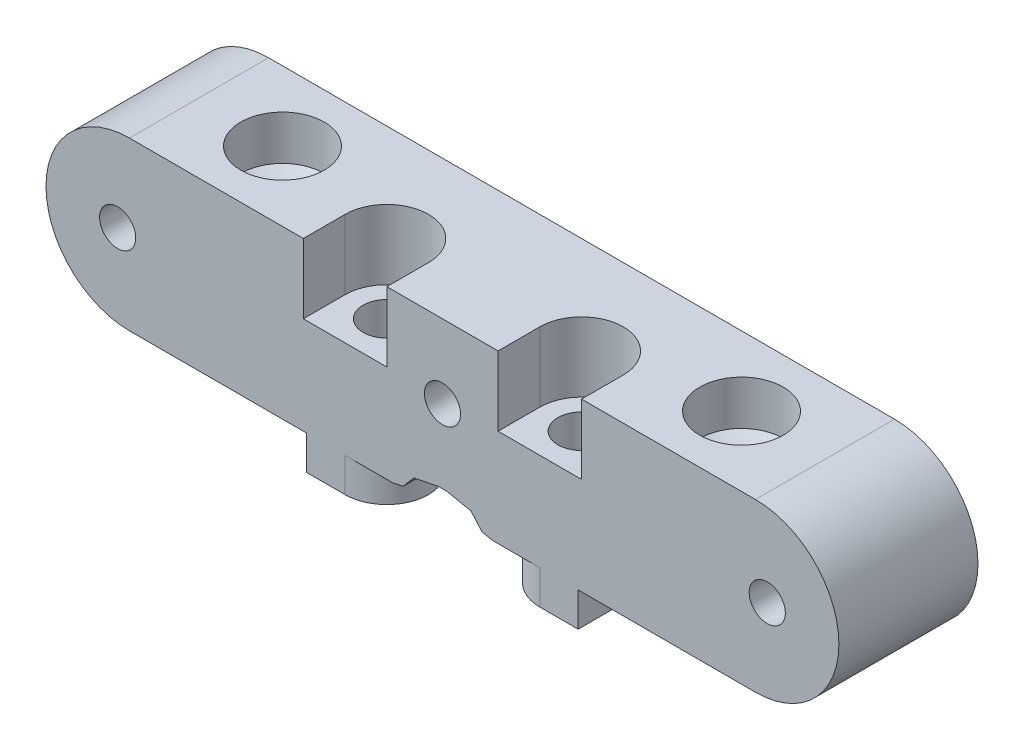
ISO-10303-21;
HEADER;
FILE_DESCRIPTION(('STEP AP214'),'2;1');
FILE_NAME('part.step','',(''),(''),'','','');
FILE_SCHEMA(('AUTOMOTIVE_DESIGN { 1 0 10303 214 1 1 1 1 }'));
ENDSEC;
DATA;
#1=APPLICATION_CONTEXT('core data for automotive mechanical design processes');
#2=APPLICATION_PROTOCOL_DEFINITION('international standard','automotive_design',2000,#1);
#3=PRODUCT_CONTEXT('',#1,'mechanical');
#4=PRODUCT('Part','Part','',(#3));
#5=PRODUCT_RELATED_PRODUCT_CATEGORY('part','',(#4));
#6=PRODUCT_DEFINITION_FORMATION('','',#4);
#7=PRODUCT_DEFINITION_CONTEXT('part definition',#1,'design');
#8=PRODUCT_DEFINITION('design','',#6,#7);
#9=PRODUCT_DEFINITION_SHAPE('','',#8);
#10=(LENGTH_UNIT() NAMED_UNIT(*) SI_UNIT(.MILLI.,.METRE.));
#11=(NAMED_UNIT(*) PLANE_ANGLE_UNIT() SI_UNIT($,.RADIAN.));
#12=(NAMED_UNIT(*) SI_UNIT($,.STERADIAN.) SOLID_ANGLE_UNIT());
#13=UNCERTAINTY_MEASURE_WITH_UNIT(LENGTH_MEASURE(1.E-05),#10,'distance_accuracy_value','');
#14=(GEOMETRIC_REPRESENTATION_CONTEXT(3) GLOBAL_UNCERTAINTY_ASSIGNED_CONTEXT((#13)) GLOBAL_UNIT_ASSIGNED_CONTEXT((#10,
#11,#12)) REPRESENTATION_CONTEXT('',''));
#15=CARTESIAN_POINT('',(0.,0.,0.));
#16=DIRECTION('',(0.,0.,1.));
#17=DIRECTION('',(1.,0.,0.));
#18=AXIS2_PLACEMENT_3D('',#15,#16,#17);
#19=CARTESIAN_POINT('',(12.0000309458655,67.1652977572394,-3.00000000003));
#20=DIRECTION('',(3.17245792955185E-12,-1.,0.));
#21=DIRECTION('',(1.,3.17245792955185E-12,0.));
#22=AXIS2_PLACEMENT_3D('',#19,#20,#21);
#23=CYLINDRICAL_SURFACE('',#22,1.6999999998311);
#24=CARTESIAN_POINT('',(12.0000309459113,52.7152977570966,-3.00000000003));
#25=DIRECTION('',(3.17245792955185E-12,-1.,0.));
#26=DIRECTION('',(1.,3.17245792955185E-12,0.));
#27=AXIS2_PLACEMENT_3D('',#24,#25,#26);
#28=CIRCLE('',#27,1.6999999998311);
#29=CARTESIAN_POINT('',(13.7000309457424,52.715297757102,-3.00000000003));
#30=VERTEX_POINT('',#29);
#31=EDGE_CURVE('E334',#30,#30,#28,.T.);
#32=ORIENTED_EDGE('',*,*,#31,.T.);
#33=EDGE_LOOP('',(#32));
#34=FACE_BOUND('',#33,.T.);
#35=CARTESIAN_POINT('',(12.0000309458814,62.1652977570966,-3.00000000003));
#36=DIRECTION('',(-3.17245792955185E-12,1.,0.));
#37=DIRECTION('',(-1.,-3.17245792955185E-12,0.));
#38=AXIS2_PLACEMENT_3D('',#35,#36,#37);
#39=CIRCLE('',#38,1.6999999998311);
#40=CARTESIAN_POINT('',(10.3000309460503,62.1652977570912,-3.00000000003));
#41=VERTEX_POINT('',#40);
#42=EDGE_CURVE('E317',#41,#41,#39,.F.);
#43=ORIENTED_EDGE('',*,*,#42,.F.);
#44=EDGE_LOOP('',(#43));
#45=FACE_BOUND('',#44,.T.);
#46=ADVANCED_FACE('F38',(#34,#45),#23,.F.);
#47=CARTESIAN_POINT('',(26.0000309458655,67.1652977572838,-3.00000000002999));
#48=DIRECTION('',(3.17245792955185E-12,-1.,0.));
#49=DIRECTION('',(1.,3.17245792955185E-12,0.));
#50=AXIS2_PLACEMENT_3D('',#47,#48,#49);
#51=CYLINDRICAL_SURFACE('',#50,1.69999999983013);
#52=CARTESIAN_POINT('',(26.0000309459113,52.715297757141,-3.00000000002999));
#53=DIRECTION('',(3.17245792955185E-12,-1.,0.));
#54=DIRECTION('',(1.,3.17245792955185E-12,0.));
#55=AXIS2_PLACEMENT_3D('',#52,#53,#54);
#56=CIRCLE('',#55,1.69999999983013);
#57=CARTESIAN_POINT('',(27.7000309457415,52.7152977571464,-3.00000000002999));
#58=VERTEX_POINT('',#57);
#59=EDGE_CURVE('E338',#58,#58,#56,.T.);
#60=ORIENTED_EDGE('',*,*,#59,.T.);
#61=EDGE_LOOP('',(#60));
#62=FACE_BOUND('',#61,.T.);
#63=CARTESIAN_POINT('',(26.0000309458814,62.165297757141,-3.00000000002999));
#64=DIRECTION('',(-3.17245792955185E-12,1.,0.));
#65=DIRECTION('',(-1.,-3.17245792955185E-12,0.));
#66=AXIS2_PLACEMENT_3D('',#63,#64,#65);
#67=CIRCLE('',#66,1.69999999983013);
#68=CARTESIAN_POINT('',(24.3000309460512,62.1652977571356,-3.00000000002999));
#69=VERTEX_POINT('',#68);
#70=EDGE_CURVE('E287',#69,#69,#67,.F.);
#71=ORIENTED_EDGE('',*,*,#70,.F.);
#72=EDGE_LOOP('',(#71));
#73=FACE_BOUND('',#72,.T.);
#74=ADVANCED_FACE('F526',(#62,#73),#51,.F.);
#75=CARTESIAN_POINT('',(-1.75009586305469E-10,55.1652977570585,0.));
#76=DIRECTION('',(3.17245792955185E-12,-1.,0.));
#77=DIRECTION('',(1.,3.17245792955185E-12,0.));
#78=AXIS2_PLACEMENT_3D('',#75,#76,#77);
#79=PLANE('',#78);
#80=CARTESIAN_POINT('',(2.49999999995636,55.1652977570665,-5.));
#81=DIRECTION('',(-3.17245792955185E-12,1.,0.));
#82=DIRECTION('',(-1.,-3.17245792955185E-12,0.));
#83=AXIS2_PLACEMENT_3D('',#80,#81,#82);
#84=CIRCLE('',#83,1.7);
#85=CARTESIAN_POINT('',(0.799999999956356,55.1652977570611,-5.));
#86=VERTEX_POINT('',#85);
#87=EDGE_CURVE('E449',#86,#86,#84,.T.);
#88=ORIENTED_EDGE('',*,*,#87,.T.);
#89=EDGE_LOOP('',(#88));
#90=FACE_BOUND('',#89,.T.);
#91=DIRECTION('',(1.,3.17245792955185E-12,0.));
#92=VECTOR('',#91,1.);
#93=CARTESIAN_POINT('',(-3.50000000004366,55.1652977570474,0.));
#94=LINE('',#93,#92);
#95=CARTESIAN_POINT('',(12.0000309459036,55.1652977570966,0.));
#96=VERTEX_POINT('',#95);
#97=CARTESIAN_POINT('',(15.4049397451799,55.1652977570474,0.));
#98=VERTEX_POINT('',#97);
#99=EDGE_CURVE('E461',#96,#98,#94,.T.);
#100=ORIENTED_EDGE('',*,*,#99,.F.);
#101=CARTESIAN_POINT('',(12.0000309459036,55.1652977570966,-3.00000000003));
#102=DIRECTION('',(3.17245792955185E-12,-1.,0.));
#103=DIRECTION('',(1.,3.17245792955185E-12,0.));
#104=AXIS2_PLACEMENT_3D('',#101,#102,#103);
#105=CIRCLE('',#104,3.00000000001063);
#106=CARTESIAN_POINT('',(12.0000309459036,55.1652977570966,-6.00000000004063));
#107=VERTEX_POINT('',#106);
#108=EDGE_CURVE('E344',#107,#96,#105,.T.);
#109=ORIENTED_EDGE('',*,*,#108,.F.);
#110=DIRECTION('',(1.,3.17251022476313E-12,-1.47436747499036E-11));
#111=VECTOR('',#110,1.);
#112=CARTESIAN_POINT('',(12.0000309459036,55.1652977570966,-6.00000000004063));
#113=LINE('',#112,#111);
#114=CARTESIAN_POINT('',(9.24416707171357,55.1652977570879,-6.));
#115=VERTEX_POINT('',#114);
#116=EDGE_CURVE('E350',#115,#107,#113,.T.);
#117=ORIENTED_EDGE('',*,*,#116,.F.);
#118=DIRECTION('',(-7.49978782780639E-12,0.,-1.));
#119=VECTOR('',#118,1.);
#120=CARTESIAN_POINT('',(9.24416707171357,55.1652977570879,-6.));
#121=LINE('',#120,#119);
#122=CARTESIAN_POINT('',(9.24416707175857,55.1652977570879,0.));
#123=VERTEX_POINT('',#122);
#124=EDGE_CURVE('E357',#123,#115,#121,.T.);
#125=ORIENTED_EDGE('',*,*,#124,.F.);
#126=CARTESIAN_POINT('',(-3.50000000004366,55.1652977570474,0.));
#127=VERTEX_POINT('',#126);
#128=EDGE_CURVE('E235',#127,#123,#94,.T.);
#129=ORIENTED_EDGE('',*,*,#128,.F.);
#130=DIRECTION('',(0.,0.,1.));
#131=VECTOR('',#130,1.);
#132=CARTESIAN_POINT('',(-3.50000000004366,55.1652977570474,0.));
#133=LINE('',#132,#131);
#134=CARTESIAN_POINT('',(-3.50000000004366,55.1652977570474,-9.99999999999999));
#135=VERTEX_POINT('',#134);
#136=EDGE_CURVE('E227',#135,#127,#133,.T.);
#137=ORIENTED_EDGE('',*,*,#136,.F.);
#138=DIRECTION('',(-1.,-3.17245792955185E-12,0.));
#139=VECTOR('',#138,1.);
#140=CARTESIAN_POINT('',(-3.50000000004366,55.1652977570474,-9.99999999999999));
#141=LINE('',#140,#139);
#142=CARTESIAN_POINT('',(15.4049397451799,55.1652977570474,-9.99999999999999));
#143=VERTEX_POINT('',#142);
#144=EDGE_CURVE('E232',#143,#135,#141,.T.);
#145=ORIENTED_EDGE('',*,*,#144,.F.);
#146=DIRECTION('',(0.,0.,-1.));
#147=VECTOR('',#146,1.);
#148=CARTESIAN_POINT('',(15.4049397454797,55.1652977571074,0.));
#149=LINE('',#148,#147);
#150=EDGE_CURVE('E447',#98,#143,#149,.T.);
#151=ORIENTED_EDGE('',*,*,#150,.F.);
#152=EDGE_LOOP('',(#100,#109,#117,#125,#129,#137,#145,#151));
#153=FACE_BOUND('',#152,.T.);
#154=ADVANCED_FACE('F230',(#90,#153),#79,.T.);
#155=CARTESIAN_POINT('',(35.500059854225,55.1652977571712,-5.));
#156=DIRECTION('',(-3.17245792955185E-12,1.,0.));
#157=DIRECTION('',(-1.,-3.17245792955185E-12,0.));
#158=AXIS2_PLACEMENT_3D('',#155,#156,#157);
#159=CIRCLE('',#158,1.7);
#160=CARTESIAN_POINT('',(33.800059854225,55.1652977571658,-5.));
#161=VERTEX_POINT('',#160);
#162=EDGE_CURVE('E241',#161,#161,#159,.T.);
#163=ORIENTED_EDGE('',*,*,#162,.T.);
#164=EDGE_LOOP('',(#163));
#165=FACE_BOUND('',#164,.T.);
#166=DIRECTION('',(1.,3.17251022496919E-12,1.43609592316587E-11));
#167=VECTOR('',#166,1.);
#168=CARTESIAN_POINT('',(28.7558948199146,55.1652977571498,-6.));
#169=LINE('',#168,#167);
#170=CARTESIAN_POINT('',(26.0000309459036,55.165297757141,-6.00000000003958));
#171=VERTEX_POINT('',#170);
#172=CARTESIAN_POINT('',(28.7558948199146,55.1652977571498,-6.));
#173=VERTEX_POINT('',#172);
#174=EDGE_CURVE('E381',#171,#173,#169,.T.);
#175=ORIENTED_EDGE('',*,*,#174,.F.);
#176=CARTESIAN_POINT('',(26.0000309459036,55.165297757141,-3.00000000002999));
#177=DIRECTION('',(3.17245792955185E-12,-1.,0.));
#178=DIRECTION('',(1.,3.17245792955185E-12,0.));
#179=AXIS2_PLACEMENT_3D('',#176,#177,#178);
#180=CIRCLE('',#179,3.00000000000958);
#181=CARTESIAN_POINT('',(26.0000380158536,55.165297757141,-2.87426332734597E-11));
#182=VERTEX_POINT('',#181);
#183=EDGE_CURVE('E379',#182,#171,#180,.T.);
#184=ORIENTED_EDGE('',*,*,#183,.F.);
#185=CARTESIAN_POINT('',(22.5951221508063,55.1652977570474,0.));
#186=VERTEX_POINT('',#185);
#187=EDGE_CURVE('E462',#186,#182,#94,.T.);
#188=ORIENTED_EDGE('',*,*,#187,.F.);
#189=DIRECTION('',(0.,0.,1.));
#190=VECTOR('',#189,1.);
#191=CARTESIAN_POINT('',(22.5951221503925,55.1652977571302,0.));
#192=LINE('',#191,#190);
#193=CARTESIAN_POINT('',(22.5951221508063,55.1652977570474,-9.99999999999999));
#194=VERTEX_POINT('',#193);
#195=EDGE_CURVE('E434',#194,#186,#192,.T.);
#196=ORIENTED_EDGE('',*,*,#195,.F.);
#197=CARTESIAN_POINT('',(41.5000618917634,55.1652977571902,-9.99999999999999));
#198=VERTEX_POINT('',#197);
#199=EDGE_CURVE('E249',#198,#194,#141,.T.);
#200=ORIENTED_EDGE('',*,*,#199,.F.);
#201=DIRECTION('',(0.,0.,-1.));
#202=VECTOR('',#201,1.);
#203=CARTESIAN_POINT('',(41.5000618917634,55.1652977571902,0.));
#204=LINE('',#203,#202);
#205=CARTESIAN_POINT('',(41.5000618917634,55.1652977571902,0.));
#206=VERTEX_POINT('',#205);
#207=EDGE_CURVE('E250',#206,#198,#204,.T.);
#208=ORIENTED_EDGE('',*,*,#207,.F.);
#209=CARTESIAN_POINT('',(28.7558948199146,55.1652977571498,0.));
#210=VERTEX_POINT('',#209);
#211=EDGE_CURVE('E240',#210,#206,#94,.T.);
#212=ORIENTED_EDGE('',*,*,#211,.F.);
#213=DIRECTION('',(-1.71107341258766E-11,0.,1.));
#214=VECTOR('',#213,1.);
#215=CARTESIAN_POINT('',(28.7558948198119,55.1652977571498,0.));
#216=LINE('',#215,#214);
#217=EDGE_CURVE('E372',#173,#210,#216,.T.);
#218=ORIENTED_EDGE('',*,*,#217,.F.);
#219=EDGE_LOOP('',(#175,#184,#188,#196,#200,#208,#212,#218));
#220=FACE_BOUND('',#219,.T.);
#221=ADVANCED_FACE('F610',(#165,#220),#79,.T.);
#222=CARTESIAN_POINT('',(-2.13079081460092E-10,67.1652977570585,0.));
#223=DIRECTION('',(3.17245792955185E-12,-1.,0.));
#224=DIRECTION('',(1.,3.17245792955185E-12,0.));
#225=AXIS2_PLACEMENT_3D('',#222,#223,#224);
#226=PLANE('',#225);
#227=CARTESIAN_POINT('',(35.5000598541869,67.1652977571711,-5.));
#228=DIRECTION('',(0.,1.,0.));
#229=DIRECTION('',(0.,0.,1.));
#230=AXIS2_PLACEMENT_3D('',#227,#228,#229);
#231=CIRCLE('',#230,2.99999999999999);
#232=CARTESIAN_POINT('',(35.5000598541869,67.1652977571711,-2.00000000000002));
#233=VERTEX_POINT('',#232);
#234=EDGE_CURVE('E320',#233,#233,#231,.T.);
#235=ORIENTED_EDGE('',*,*,#234,.F.);
#236=EDGE_LOOP('',(#235));
#237=FACE_BOUND('',#236,.T.);
#238=CARTESIAN_POINT('',(2.49999999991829,67.1652977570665,-5.));
#239=DIRECTION('',(0.,1.,0.));
#240=DIRECTION('',(0.,0.,1.));
#241=AXIS2_PLACEMENT_3D('',#238,#239,#240);
#242=CIRCLE('',#241,2.99999999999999);
#243=CARTESIAN_POINT('',(2.49999999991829,67.1652977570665,-2.00000000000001));
#244=VERTEX_POINT('',#243);
#245=EDGE_CURVE('E327',#244,#244,#242,.T.);
#246=ORIENTED_EDGE('',*,*,#245,.F.);
#247=EDGE_LOOP('',(#246));
#248=FACE_BOUND('',#247,.T.);
#249=CARTESIAN_POINT('',(12.0000309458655,67.1652977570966,-3.00000000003));
#250=DIRECTION('',(-3.17245792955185E-12,1.,0.));
#251=DIRECTION('',(-1.,-3.17245792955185E-12,0.));
#252=AXIS2_PLACEMENT_3D('',#249,#250,#251);
#253=CIRCLE('',#252,3.);
#254=CARTESIAN_POINT('',(15.0000309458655,67.1652977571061,-3.00000000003));
#255=VERTEX_POINT('',#254);
#256=CARTESIAN_POINT('',(9.0000309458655,67.1652977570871,-3.00000000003));
#257=VERTEX_POINT('',#256);
#258=EDGE_CURVE('E277',#255,#257,#253,.T.);
#259=ORIENTED_EDGE('',*,*,#258,.F.);
#260=DIRECTION('',(0.,0.,-1.));
#261=VECTOR('',#260,1.);
#262=CARTESIAN_POINT('',(15.0000309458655,67.1652977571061,-3.00000000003));
#263=LINE('',#262,#261);
#264=CARTESIAN_POINT('',(15.0000309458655,67.1652977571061,0.));
#265=VERTEX_POINT('',#264);
#266=EDGE_CURVE('E271',#265,#255,#263,.T.);
#267=ORIENTED_EDGE('',*,*,#266,.F.);
#268=DIRECTION('',(-1.,-1.50274040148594E-11,0.));
#269=VECTOR('',#268,1.);
#270=CARTESIAN_POINT('',(-3.50000000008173,67.1652977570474,0.));
#271=LINE('',#270,#269);
#272=CARTESIAN_POINT('',(23.0000309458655,67.1652977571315,0.));
#273=VERTEX_POINT('',#272);
#274=EDGE_CURVE('E345',#273,#265,#271,.T.);
#275=ORIENTED_EDGE('',*,*,#274,.F.);
#276=DIRECTION('',(0.,0.,1.));
#277=VECTOR('',#276,1.);
#278=CARTESIAN_POINT('',(23.0000309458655,67.1652977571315,-3.00000000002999));
#279=LINE('',#278,#277);
#280=CARTESIAN_POINT('',(23.0000309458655,67.1652977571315,-3.00000000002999));
#281=VERTEX_POINT('',#280);
#282=EDGE_CURVE('E304',#281,#273,#279,.T.);
#283=ORIENTED_EDGE('',*,*,#282,.F.);
#284=CARTESIAN_POINT('',(26.0000309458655,67.165297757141,-3.00000000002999));
#285=DIRECTION('',(-3.17245792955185E-12,1.,0.));
#286=DIRECTION('',(-1.,-3.17245792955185E-12,0.));
#287=AXIS2_PLACEMENT_3D('',#284,#285,#286);
#288=CIRCLE('',#287,3.);
#289=CARTESIAN_POINT('',(29.0000309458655,67.1652977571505,-3.00000000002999));
#290=VERTEX_POINT('',#289);
#291=EDGE_CURVE('E267',#290,#281,#288,.T.);
#292=ORIENTED_EDGE('',*,*,#291,.F.);
#293=DIRECTION('',(0.,0.,-1.));
#294=VECTOR('',#293,1.);
#295=CARTESIAN_POINT('',(29.0000309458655,67.1652977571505,-3.00000000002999));
#296=LINE('',#295,#294);
#297=CARTESIAN_POINT('',(29.0000309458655,67.1652977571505,0.));
#298=VERTEX_POINT('',#297);
#299=EDGE_CURVE('E296',#298,#290,#296,.T.);
#300=ORIENTED_EDGE('',*,*,#299,.F.);
#301=CARTESIAN_POINT('',(41.5000618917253,67.1652977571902,0.));
#302=VERTEX_POINT('',#301);
#303=EDGE_CURVE('E341',#302,#298,#271,.T.);
#304=ORIENTED_EDGE('',*,*,#303,.F.);
#305=DIRECTION('',(0.,0.,-1.));
#306=VECTOR('',#305,1.);
#307=CARTESIAN_POINT('',(41.5000618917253,67.1652977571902,0.));
#308=LINE('',#307,#306);
#309=CARTESIAN_POINT('',(41.5000618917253,67.1652977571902,-9.99999999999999));
#310=VERTEX_POINT('',#309);
#311=EDGE_CURVE('E455',#302,#310,#308,.T.);
#312=ORIENTED_EDGE('',*,*,#311,.T.);
#313=DIRECTION('',(-1.,-3.17245792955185E-12,0.));
#314=VECTOR('',#313,1.);
#315=CARTESIAN_POINT('',(-3.50000000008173,67.1652977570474,-9.99999999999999));
#316=LINE('',#315,#314);
#317=CARTESIAN_POINT('',(-3.50000000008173,67.1652977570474,-9.99999999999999));
#318=VERTEX_POINT('',#317);
#319=EDGE_CURVE('E47',#310,#318,#316,.T.);
#320=ORIENTED_EDGE('',*,*,#319,.T.);
#321=DIRECTION('',(0.,0.,1.));
#322=VECTOR('',#321,1.);
#323=CARTESIAN_POINT('',(-3.50000000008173,67.1652977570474,0.));
#324=LINE('',#323,#322);
#325=CARTESIAN_POINT('',(-3.50000000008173,67.1652977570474,0.));
#326=VERTEX_POINT('',#325);
#327=EDGE_CURVE('E255',#318,#326,#324,.T.);
#328=ORIENTED_EDGE('',*,*,#327,.T.);
#329=CARTESIAN_POINT('',(9.0000309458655,67.1652977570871,0.));
#330=VERTEX_POINT('',#329);
#331=EDGE_CURVE('E337',#330,#326,#271,.T.);
#332=ORIENTED_EDGE('',*,*,#331,.F.);
#333=DIRECTION('',(0.,0.,1.));
#334=VECTOR('',#333,1.);
#335=CARTESIAN_POINT('',(9.0000309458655,67.1652977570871,-3.00000000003));
#336=LINE('',#335,#334);
#337=EDGE_CURVE('E280',#257,#330,#336,.T.);
#338=ORIENTED_EDGE('',*,*,#337,.F.);
#339=EDGE_LOOP('',(#259,#267,#275,#283,#292,#300,#304,#312,#320,#328,#332,#338));
#340=FACE_BOUND('',#339,.T.);
#341=ADVANCED_FACE('F607',(#237,#248,#340),#226,.F.);
#342=CARTESIAN_POINT('',(-3.50000000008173,67.1652977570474,0.));
#343=DIRECTION('',(0.,0.,-1.));
#344=DIRECTION('',(-1.,0.,0.));
#345=AXIS2_PLACEMENT_3D('',#342,#343,#344);
#346=PLANE('',#345);
#347=CARTESIAN_POINT('',(-4.35000000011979,61.1652977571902,0.));
#348=DIRECTION('',(0.,0.,-1.));
#349=DIRECTION('',(-1.,0.,0.));
#350=AXIS2_PLACEMENT_3D('',#347,#348,#349);
#351=CIRCLE('',#350,1.3);
#352=CARTESIAN_POINT('',(-5.65000000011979,61.1652977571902,0.));
#353=VERTEX_POINT('',#352);
#354=EDGE_CURVE('E257',#353,#353,#351,.T.);
#355=ORIENTED_EDGE('',*,*,#354,.T.);
#356=EDGE_LOOP('',(#355));
#357=FACE_BOUND('',#356,.T.);
#358=CARTESIAN_POINT('',(42.3500618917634,61.1652977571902,0.));
#359=DIRECTION('',(0.,0.,-1.));
#360=DIRECTION('',(-1.,0.,0.));
#361=AXIS2_PLACEMENT_3D('',#358,#359,#360);
#362=CIRCLE('',#361,1.3);
#363=CARTESIAN_POINT('',(41.0500618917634,61.1652977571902,0.));
#364=VERTEX_POINT('',#363);
#365=EDGE_CURVE('E262',#364,#364,#362,.T.);
#366=ORIENTED_EDGE('',*,*,#365,.T.);
#367=EDGE_LOOP('',(#366));
#368=FACE_BOUND('',#367,.T.);
#369=CARTESIAN_POINT('',(19.0000309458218,61.8726338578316,0.));
#370=DIRECTION('',(0.,0.,-1.));
#371=DIRECTION('',(-1.,0.,0.));
#372=AXIS2_PLACEMENT_3D('',#369,#370,#371);
#373=CIRCLE('',#372,1.3);
#374=CARTESIAN_POINT('',(17.7000309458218,61.8726338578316,0.));
#375=VERTEX_POINT('',#374);
#376=EDGE_CURVE('E482',#375,#375,#373,.T.);
#377=ORIENTED_EDGE('',*,*,#376,.T.);
#378=EDGE_LOOP('',(#377));
#379=FACE_BOUND('',#378,.T.);
#380=ORIENTED_EDGE('',*,*,#274,.T.);
#381=DIRECTION('',(-3.17245792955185E-12,1.,0.));
#382=VECTOR('',#381,1.);
#383=CARTESIAN_POINT('',(15.0000309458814,62.1652977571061,0.));
#384=LINE('',#383,#382);
#385=CARTESIAN_POINT('',(15.0000309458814,62.1652977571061,0.));
#386=VERTEX_POINT('',#385);
#387=EDGE_CURVE('E288',#386,#265,#384,.T.);
#388=ORIENTED_EDGE('',*,*,#387,.F.);
#389=DIRECTION('',(1.,3.17245792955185E-12,0.));
#390=VECTOR('',#389,1.);
#391=CARTESIAN_POINT('',(-3.50000000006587,62.1652977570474,0.));
#392=LINE('',#391,#390);
#393=CARTESIAN_POINT('',(9.00003094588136,62.1652977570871,0.));
#394=VERTEX_POINT('',#393);
#395=EDGE_CURVE('E318',#394,#386,#392,.T.);
#396=ORIENTED_EDGE('',*,*,#395,.F.);
#397=DIRECTION('',(-3.17245792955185E-12,1.,0.));
#398=VECTOR('',#397,1.);
#399=CARTESIAN_POINT('',(9.00003094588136,62.1652977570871,0.));
#400=LINE('',#399,#398);
#401=EDGE_CURVE('E290',#394,#330,#400,.T.);
#402=ORIENTED_EDGE('',*,*,#401,.T.);
#403=ORIENTED_EDGE('',*,*,#331,.T.);
#404=CARTESIAN_POINT('',(-3.50000000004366,61.1652977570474,0.));
#405=DIRECTION('',(0.,0.,-1.));
#406=DIRECTION('',(-1.,0.,0.));
#407=AXIS2_PLACEMENT_3D('',#404,#405,#406);
#408=CIRCLE('',#407,6.);
#409=EDGE_CURVE('E256',#326,#127,#408,.F.);
#410=ORIENTED_EDGE('',*,*,#409,.T.);
#411=ORIENTED_EDGE('',*,*,#128,.T.);
#412=DIRECTION('',(-3.17245792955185E-12,1.,0.));
#413=VECTOR('',#412,1.);
#414=CARTESIAN_POINT('',(9.24416707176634,52.7152977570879,0.));
#415=LINE('',#414,#413);
#416=CARTESIAN_POINT('',(9.24416707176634,52.7152977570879,0.));
#417=VERTEX_POINT('',#416);
#418=EDGE_CURVE('E365',#417,#123,#415,.T.);
#419=ORIENTED_EDGE('',*,*,#418,.F.);
#420=DIRECTION('',(-1.,-3.1725212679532E-12,1.25928321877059E-11));
#421=VECTOR('',#420,1.);
#422=CARTESIAN_POINT('',(9.24416707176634,52.7152977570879,0.));
#423=LINE('',#422,#421);
#424=CARTESIAN_POINT('',(12.0000213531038,52.7152977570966,-3.47009668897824E-11));
#425=VERTEX_POINT('',#424);
#426=EDGE_CURVE('E349',#425,#417,#423,.T.);
#427=ORIENTED_EDGE('',*,*,#426,.F.);
#428=DIRECTION('',(-3.17245792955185E-12,1.,0.));
#429=VECTOR('',#428,1.);
#430=CARTESIAN_POINT('',(12.0000213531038,52.7152977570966,-3.47009668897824E-11));
#431=LINE('',#430,#429);
#432=EDGE_CURVE('E367',#425,#96,#431,.T.);
#433=ORIENTED_EDGE('',*,*,#432,.T.);
#434=ORIENTED_EDGE('',*,*,#99,.T.);
#435=DIRECTION('',(0.980562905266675,0.19620496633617,0.));
#436=VECTOR('',#435,1.);
#437=CARTESIAN_POINT('',(9.61383210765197,54.0065306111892,0.));
#438=LINE('',#437,#436);
#439=CARTESIAN_POINT('',(16.1573875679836,55.3158582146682,0.));
#440=VERTEX_POINT('',#439);
#441=EDGE_CURVE('E411',#98,#440,#438,.T.);
#442=ORIENTED_EDGE('',*,*,#441,.T.);
#443=DIRECTION('',(0.655175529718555,0.755476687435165,0.));
#444=VECTOR('',#443,1.);
#445=CARTESIAN_POINT('',(16.1573875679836,55.3158582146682,0.));
#446=LINE('',#445,#444);
#447=CARTESIAN_POINT('',(16.9502580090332,56.2301095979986,0.));
#448=VERTEX_POINT('',#447);
#449=EDGE_CURVE('E414',#440,#448,#446,.T.);
#450=ORIENTED_EDGE('',*,*,#449,.T.);
#451=DIRECTION('',(0.980600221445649,0.196018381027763,0.));
#452=VECTOR('',#451,1.);
#453=CARTESIAN_POINT('',(16.9502580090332,56.2301095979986,0.));
#454=LINE('',#453,#452);
#455=CARTESIAN_POINT('',(18.7004670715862,56.5799699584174,0.));
#456=VERTEX_POINT('',#455);
#457=EDGE_CURVE('E395',#448,#456,#454,.T.);
#458=ORIENTED_EDGE('',*,*,#457,.T.);
#459=DIRECTION('',(1.,9.27575153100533E-11,0.));
#460=VECTOR('',#459,1.);
#461=CARTESIAN_POINT('',(18.7004670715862,56.5799699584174,0.));
#462=LINE('',#461,#460);
#463=CARTESIAN_POINT('',(19.2995948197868,56.579969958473,0.));
#464=VERTEX_POINT('',#463);
#465=EDGE_CURVE('E398',#456,#464,#462,.T.);
#466=ORIENTED_EDGE('',*,*,#465,.T.);
#467=DIRECTION('',(0.980600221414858,-0.196018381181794,0.));
#468=VECTOR('',#467,1.);
#469=CARTESIAN_POINT('',(19.2995948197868,56.579969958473,0.));
#470=LINE('',#469,#468);
#471=CARTESIAN_POINT('',(21.0498040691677,56.2301095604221,0.));
#472=VERTEX_POINT('',#471);
#473=EDGE_CURVE('E402',#464,#472,#470,.T.);
#474=ORIENTED_EDGE('',*,*,#473,.T.);
#475=DIRECTION('',(0.655175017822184,-0.755477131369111,0.));
#476=VECTOR('',#475,1.);
#477=CARTESIAN_POINT('',(21.0498040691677,56.2301095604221,0.));
#478=LINE('',#477,#476);
#479=CARTESIAN_POINT('',(21.842673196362,55.3158584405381,0.));
#480=VERTEX_POINT('',#479);
#481=EDGE_CURVE('E405',#472,#480,#478,.T.);
#482=ORIENTED_EDGE('',*,*,#481,.T.);
#483=DIRECTION('',(0.980562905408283,-0.196204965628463,0.));
#484=VECTOR('',#483,1.);
#485=CARTESIAN_POINT('',(21.842673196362,55.3158584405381,0.));
#486=LINE('',#485,#484);
#487=EDGE_CURVE('E408',#480,#186,#486,.T.);
#488=ORIENTED_EDGE('',*,*,#487,.T.);
#489=ORIENTED_EDGE('',*,*,#187,.T.);
#490=DIRECTION('',(-3.17245792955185E-12,1.,0.));
#491=VECTOR('',#490,1.);
#492=CARTESIAN_POINT('',(26.0000380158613,52.715297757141,-2.87426332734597E-11));
#493=LINE('',#492,#491);
#494=CARTESIAN_POINT('',(26.0000380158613,52.715297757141,-2.87426332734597E-11));
#495=VERTEX_POINT('',#494);
#496=EDGE_CURVE('E392',#495,#182,#493,.T.);
#497=ORIENTED_EDGE('',*,*,#496,.F.);
#498=DIRECTION('',(-1.,-3.1725183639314E-12,-1.04313851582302E-11));
#499=VECTOR('',#498,1.);
#500=CARTESIAN_POINT('',(26.0000380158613,52.715297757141,-2.87426254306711E-11));
#501=LINE('',#500,#499);
#502=CARTESIAN_POINT('',(28.7558948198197,52.7152977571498,0.));
#503=VERTEX_POINT('',#502);
#504=EDGE_CURVE('E368',#503,#495,#501,.T.);
#505=ORIENTED_EDGE('',*,*,#504,.F.);
#506=DIRECTION('',(-3.17245792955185E-12,1.,0.));
#507=VECTOR('',#506,1.);
#508=CARTESIAN_POINT('',(28.7558948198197,52.7152977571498,0.));
#509=LINE('',#508,#507);
#510=EDGE_CURVE('E378',#503,#210,#509,.T.);
#511=ORIENTED_EDGE('',*,*,#510,.T.);
#512=ORIENTED_EDGE('',*,*,#211,.T.);
#513=CARTESIAN_POINT('',(41.5000618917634,61.1652977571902,0.));
#514=DIRECTION('',(0.,0.,-1.));
#515=DIRECTION('',(-1.,0.,0.));
#516=AXIS2_PLACEMENT_3D('',#513,#514,#515);
#517=CIRCLE('',#516,6.);
#518=EDGE_CURVE('E265',#206,#302,#517,.F.);
#519=ORIENTED_EDGE('',*,*,#518,.T.);
#520=ORIENTED_EDGE('',*,*,#303,.T.);
#521=DIRECTION('',(-3.17245792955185E-12,1.,0.));
#522=VECTOR('',#521,1.);
#523=CARTESIAN_POINT('',(29.0000309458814,62.1652977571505,0.));
#524=LINE('',#523,#522);
#525=CARTESIAN_POINT('',(29.0000309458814,62.1652977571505,0.));
#526=VERTEX_POINT('',#525);
#527=EDGE_CURVE('E309',#526,#298,#524,.T.);
#528=ORIENTED_EDGE('',*,*,#527,.F.);
#529=DIRECTION('',(1.,3.17245792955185E-12,0.));
#530=VECTOR('',#529,1.);
#531=CARTESIAN_POINT('',(-3.50000000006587,62.1652977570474,0.));
#532=LINE('',#531,#530);
#533=CARTESIAN_POINT('',(23.0000309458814,62.1652977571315,0.));
#534=VERTEX_POINT('',#533);
#535=EDGE_CURVE('E315',#534,#526,#532,.T.);
#536=ORIENTED_EDGE('',*,*,#535,.F.);
#537=DIRECTION('',(-3.17245792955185E-12,1.,0.));
#538=VECTOR('',#537,1.);
#539=CARTESIAN_POINT('',(23.0000309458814,62.1652977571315,0.));
#540=LINE('',#539,#538);
#541=EDGE_CURVE('E311',#534,#273,#540,.T.);
#542=ORIENTED_EDGE('',*,*,#541,.T.);
#543=EDGE_LOOP('',(#380,#388,#396,#402,#403,#410,#411,#419,#427,#433,#434,#442,#450,#458,#466,
#474,#482,#488,#489,#497,#505,#511,#512,#519,#520,#528,#536,#542));
#544=FACE_BOUND('',#543,.T.);
#545=ADVANCED_FACE('F40',(#357,#368,#379,#544),#346,.F.);
#546=CARTESIAN_POINT('',(-3.50000000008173,67.1652977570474,-9.99999999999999));
#547=DIRECTION('',(0.,0.,1.));
#548=DIRECTION('',(1.,0.,0.));
#549=AXIS2_PLACEMENT_3D('',#546,#547,#548);
#550=PLANE('',#549);
#551=CARTESIAN_POINT('',(19.0000309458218,61.8726338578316,-9.99999999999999));
#552=DIRECTION('',(0.,0.,-1.));
#553=DIRECTION('',(-1.,0.,0.));
#554=AXIS2_PLACEMENT_3D('',#551,#552,#553);
#555=CIRCLE('',#554,2.3);
#556=CARTESIAN_POINT('',(16.7000309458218,61.8726338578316,-9.99999999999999));
#557=VERTEX_POINT('',#556);
#558=EDGE_CURVE('E623',#557,#557,#555,.T.);
#559=ORIENTED_EDGE('',*,*,#558,.F.);
#560=EDGE_LOOP('',(#559));
#561=FACE_BOUND('',#560,.T.);
#562=CARTESIAN_POINT('',(42.3500618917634,61.1652977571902,-9.99999999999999));
#563=DIRECTION('',(0.,0.,-1.));
#564=DIRECTION('',(-1.,0.,0.));
#565=AXIS2_PLACEMENT_3D('',#562,#563,#564);
#566=CIRCLE('',#565,2.3);
#567=CARTESIAN_POINT('',(40.0500618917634,61.1652977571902,-9.99999999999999));
#568=VERTEX_POINT('',#567);
#569=EDGE_CURVE('E493',#568,#568,#566,.T.);
#570=ORIENTED_EDGE('',*,*,#569,.F.);
#571=EDGE_LOOP('',(#570));
#572=FACE_BOUND('',#571,.T.);
#573=CARTESIAN_POINT('',(-4.35000000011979,61.1652977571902,-9.99999999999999));
#574=DIRECTION('',(0.,0.,-1.));
#575=DIRECTION('',(-1.,0.,0.));
#576=AXIS2_PLACEMENT_3D('',#573,#574,#575);
#577=CIRCLE('',#576,2.3);
#578=CARTESIAN_POINT('',(-6.65000000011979,61.1652977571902,-9.99999999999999));
#579=VERTEX_POINT('',#578);
#580=EDGE_CURVE('E486',#579,#579,#577,.T.);
#581=ORIENTED_EDGE('',*,*,#580,.F.);
#582=EDGE_LOOP('',(#581));
#583=FACE_BOUND('',#582,.T.);
#584=DIRECTION('',(0.655175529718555,0.755476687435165,0.));
#585=VECTOR('',#584,1.);
#586=CARTESIAN_POINT('',(16.1573875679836,55.3158582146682,-9.99999999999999));
#587=LINE('',#586,#585);
#588=CARTESIAN_POINT('',(16.1573875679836,55.3158582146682,-9.99999999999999));
#589=VERTEX_POINT('',#588);
#590=CARTESIAN_POINT('',(16.9502580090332,56.2301095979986,-9.99999999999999));
#591=VERTEX_POINT('',#590);
#592=EDGE_CURVE('E399',#589,#591,#587,.T.);
#593=ORIENTED_EDGE('',*,*,#592,.F.);
#594=DIRECTION('',(-0.980562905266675,-0.19620496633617,0.));
#595=VECTOR('',#594,1.);
#596=CARTESIAN_POINT('',(-0.463532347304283,51.9901082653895,-9.99999999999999));
#597=LINE('',#596,#595);
#598=EDGE_CURVE('E11',#589,#143,#597,.T.);
#599=ORIENTED_EDGE('',*,*,#598,.T.);
#600=ORIENTED_EDGE('',*,*,#144,.T.);
#601=CARTESIAN_POINT('',(-3.50000000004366,61.1652977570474,-9.99999999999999));
#602=DIRECTION('',(0.,0.,-1.));
#603=DIRECTION('',(1.,0.,0.));
#604=AXIS2_PLACEMENT_3D('',#601,#602,#603);
#605=CIRCLE('',#604,6.);
#606=EDGE_CURVE('E248',#135,#318,#605,.T.);
#607=ORIENTED_EDGE('',*,*,#606,.T.);
#608=ORIENTED_EDGE('',*,*,#319,.F.);
#609=CARTESIAN_POINT('',(41.5000618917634,61.1652977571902,-9.99999999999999));
#610=DIRECTION('',(0.,0.,-1.));
#611=DIRECTION('',(-1.,0.,0.));
#612=AXIS2_PLACEMENT_3D('',#609,#610,#611);
#613=CIRCLE('',#612,6.);
#614=EDGE_CURVE('E259',#310,#198,#613,.T.);
#615=ORIENTED_EDGE('',*,*,#614,.T.);
#616=ORIENTED_EDGE('',*,*,#199,.T.);
#617=DIRECTION('',(0.980562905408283,-0.196204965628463,0.));
#618=VECTOR('',#617,1.);
#619=CARTESIAN_POINT('',(21.842673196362,55.3158584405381,-9.99999999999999));
#620=LINE('',#619,#618);
#621=CARTESIAN_POINT('',(21.842673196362,55.3158584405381,-9.99999999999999));
#622=VERTEX_POINT('',#621);
#623=EDGE_CURVE('E428',#622,#194,#620,.T.);
#624=ORIENTED_EDGE('',*,*,#623,.F.);
#625=DIRECTION('',(0.655175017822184,-0.755477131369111,0.));
#626=VECTOR('',#625,1.);
#627=CARTESIAN_POINT('',(21.0498040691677,56.2301095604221,-9.99999999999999));
#628=LINE('',#627,#626);
#629=CARTESIAN_POINT('',(21.0498040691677,56.2301095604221,-9.99999999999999));
#630=VERTEX_POINT('',#629);
#631=EDGE_CURVE('E425',#630,#622,#628,.T.);
#632=ORIENTED_EDGE('',*,*,#631,.F.);
#633=DIRECTION('',(0.980600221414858,-0.196018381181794,0.));
#634=VECTOR('',#633,1.);
#635=CARTESIAN_POINT('',(19.2995948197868,56.579969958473,-9.99999999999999));
#636=LINE('',#635,#634);
#637=CARTESIAN_POINT('',(19.2995948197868,56.579969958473,-9.99999999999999));
#638=VERTEX_POINT('',#637);
#639=EDGE_CURVE('E422',#638,#630,#636,.T.);
#640=ORIENTED_EDGE('',*,*,#639,.F.);
#641=DIRECTION('',(1.,9.27575153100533E-11,0.));
#642=VECTOR('',#641,1.);
#643=CARTESIAN_POINT('',(18.7004670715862,56.5799699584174,-9.99999999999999));
#644=LINE('',#643,#642);
#645=CARTESIAN_POINT('',(18.7004670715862,56.5799699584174,-9.99999999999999));
#646=VERTEX_POINT('',#645);
#647=EDGE_CURVE('E419',#646,#638,#644,.T.);
#648=ORIENTED_EDGE('',*,*,#647,.F.);
#649=DIRECTION('',(0.980600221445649,0.196018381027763,0.));
#650=VECTOR('',#649,1.);
#651=CARTESIAN_POINT('',(16.9502580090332,56.2301095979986,-9.99999999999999));
#652=LINE('',#651,#650);
#653=EDGE_CURVE('E394',#591,#646,#652,.T.);
#654=ORIENTED_EDGE('',*,*,#653,.F.);
#655=EDGE_LOOP('',(#593,#599,#600,#607,#608,#615,#616,#624,#632,#640,#648,#654));
#656=FACE_BOUND('',#655,.T.);
#657=ADVANCED_FACE('F246',(#561,#572,#583,#656),#550,.F.);
#658=CARTESIAN_POINT('',(35.5000598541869,67.1652977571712,-5.));
#659=DIRECTION('',(3.17245792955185E-12,-1.,0.));
#660=DIRECTION('',(1.,3.17245792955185E-12,0.));
#661=AXIS2_PLACEMENT_3D('',#658,#659,#660);
#662=CYLINDRICAL_SURFACE('',#661,1.7);
#663=CARTESIAN_POINT('',(35.5000598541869,63.186760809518,-5.));
#664=DIRECTION('',(0.,1.,0.));
#665=DIRECTION('',(0.,0.,1.));
#666=AXIS2_PLACEMENT_3D('',#663,#664,#665);
#667=CIRCLE('',#666,1.7);
#668=CARTESIAN_POINT('',(35.5000598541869,63.186760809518,-3.30000000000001));
#669=VERTEX_POINT('',#668);
#670=EDGE_CURVE('E326',#669,#669,#667,.F.);
#671=ORIENTED_EDGE('',*,*,#670,.F.);
#672=EDGE_LOOP('',(#671));
#673=FACE_BOUND('',#672,.T.);
#674=ORIENTED_EDGE('',*,*,#162,.F.);
#675=EDGE_LOOP('',(#674));
#676=FACE_BOUND('',#675,.T.);
#677=ADVANCED_FACE('F602',(#673,#676),#662,.F.);
#678=CARTESIAN_POINT('',(2.49999999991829,67.1652977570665,-5.));
#679=DIRECTION('',(3.17245792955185E-12,-1.,0.));
#680=DIRECTION('',(1.,3.17245792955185E-12,0.));
#681=AXIS2_PLACEMENT_3D('',#678,#679,#680);
#682=CYLINDRICAL_SURFACE('',#681,1.7);
#683=CARTESIAN_POINT('',(2.49999999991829,63.1867608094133,-5.));
#684=DIRECTION('',(0.,1.,0.));
#685=DIRECTION('',(0.,0.,1.));
#686=AXIS2_PLACEMENT_3D('',#683,#684,#685);
#687=CIRCLE('',#686,1.7);
#688=CARTESIAN_POINT('',(2.49999999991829,63.1867608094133,-3.3));
#689=VERTEX_POINT('',#688);
#690=EDGE_CURVE('E333',#689,#689,#687,.F.);
#691=ORIENTED_EDGE('',*,*,#690,.F.);
#692=EDGE_LOOP('',(#691));
#693=FACE_BOUND('',#692,.T.);
#694=ORIENTED_EDGE('',*,*,#87,.F.);
#695=EDGE_LOOP('',(#694));
#696=FACE_BOUND('',#695,.T.);
#697=ADVANCED_FACE('F598',(#693,#696),#682,.F.);
#698=CARTESIAN_POINT('',(16.9502580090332,56.2301095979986,0.));
#699=DIRECTION('',(-0.196018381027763,0.980600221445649,0.));
#700=DIRECTION('',(-0.980600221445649,-0.196018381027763,0.));
#701=AXIS2_PLACEMENT_3D('',#698,#699,#700);
#702=PLANE('',#701);
#703=ORIENTED_EDGE('',*,*,#653,.T.);
#704=DIRECTION('',(0.,0.,-1.));
#705=VECTOR('',#704,1.);
#706=CARTESIAN_POINT('',(18.7004670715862,56.5799699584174,0.));
#707=LINE('',#706,#705);
#708=EDGE_CURVE('E417',#456,#646,#707,.T.);
#709=ORIENTED_EDGE('',*,*,#708,.F.);
#710=ORIENTED_EDGE('',*,*,#457,.F.);
#711=DIRECTION('',(0.,0.,-1.));
#712=VECTOR('',#711,1.);
#713=CARTESIAN_POINT('',(16.9502580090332,56.2301095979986,0.));
#714=LINE('',#713,#712);
#715=EDGE_CURVE('E432',#448,#591,#714,.T.);
#716=ORIENTED_EDGE('',*,*,#715,.T.);
#717=EDGE_LOOP('',(#703,#709,#710,#716));
#718=FACE_BOUND('',#717,.T.);
#719=ADVANCED_FACE('F576',(#718),#702,.F.);
#720=CARTESIAN_POINT('',(16.1573875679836,55.3158582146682,0.));
#721=DIRECTION('',(-0.755476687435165,0.655175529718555,0.));
#722=DIRECTION('',(-0.655175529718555,-0.755476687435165,0.));
#723=AXIS2_PLACEMENT_3D('',#720,#721,#722);
#724=PLANE('',#723);
#725=ORIENTED_EDGE('',*,*,#592,.T.);
#726=ORIENTED_EDGE('',*,*,#715,.F.);
#727=ORIENTED_EDGE('',*,*,#449,.F.);
#728=DIRECTION('',(0.,0.,-1.));
#729=VECTOR('',#728,1.);
#730=CARTESIAN_POINT('',(16.1573875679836,55.3158582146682,0.));
#731=LINE('',#730,#729);
#732=EDGE_CURVE('E435',#440,#589,#731,.T.);
#733=ORIENTED_EDGE('',*,*,#732,.T.);
#734=EDGE_LOOP('',(#725,#726,#727,#733));
#735=FACE_BOUND('',#734,.T.);
#736=ADVANCED_FACE('F572',(#735),#724,.F.);
#737=CARTESIAN_POINT('',(9.61383210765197,54.0065306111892,0.));
#738=DIRECTION('',(-0.19620496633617,0.980562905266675,0.));
#739=DIRECTION('',(-0.980562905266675,-0.19620496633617,0.));
#740=AXIS2_PLACEMENT_3D('',#737,#738,#739);
#741=PLANE('',#740);
#742=ORIENTED_EDGE('',*,*,#150,.T.);
#743=ORIENTED_EDGE('',*,*,#598,.F.);
#744=ORIENTED_EDGE('',*,*,#732,.F.);
#745=ORIENTED_EDGE('',*,*,#441,.F.);
#746=EDGE_LOOP('',(#742,#743,#744,#745));
#747=FACE_BOUND('',#746,.T.);
#748=ADVANCED_FACE('F575',(#747),#741,.F.);
#749=CARTESIAN_POINT('',(21.842673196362,55.3158584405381,0.));
#750=DIRECTION('',(0.196204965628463,0.980562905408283,0.));
#751=DIRECTION('',(-0.980562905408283,0.196204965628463,0.));
#752=AXIS2_PLACEMENT_3D('',#749,#750,#751);
#753=PLANE('',#752);
#754=ORIENTED_EDGE('',*,*,#195,.T.);
#755=ORIENTED_EDGE('',*,*,#487,.F.);
#756=DIRECTION('',(0.,0.,-1.));
#757=VECTOR('',#756,1.);
#758=CARTESIAN_POINT('',(21.842673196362,55.3158584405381,0.));
#759=LINE('',#758,#757);
#760=EDGE_CURVE('E438',#480,#622,#759,.T.);
#761=ORIENTED_EDGE('',*,*,#760,.T.);
#762=ORIENTED_EDGE('',*,*,#623,.T.);
#763=EDGE_LOOP('',(#754,#755,#761,#762));
#764=FACE_BOUND('',#763,.T.);
#765=ADVANCED_FACE('F580',(#764),#753,.F.);
#766=CARTESIAN_POINT('',(21.0498040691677,56.2301095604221,0.));
#767=DIRECTION('',(0.755477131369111,0.655175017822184,0.));
#768=DIRECTION('',(-0.655175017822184,0.755477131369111,0.));
#769=AXIS2_PLACEMENT_3D('',#766,#767,#768);
#770=PLANE('',#769);
#771=ORIENTED_EDGE('',*,*,#631,.T.);
#772=ORIENTED_EDGE('',*,*,#760,.F.);
#773=ORIENTED_EDGE('',*,*,#481,.F.);
#774=DIRECTION('',(0.,0.,-1.));
#775=VECTOR('',#774,1.);
#776=CARTESIAN_POINT('',(21.0498040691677,56.2301095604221,0.));
#777=LINE('',#776,#775);
#778=EDGE_CURVE('E440',#472,#630,#777,.T.);
#779=ORIENTED_EDGE('',*,*,#778,.T.);
#780=EDGE_LOOP('',(#771,#772,#773,#779));
#781=FACE_BOUND('',#780,.T.);
#782=ADVANCED_FACE('F584',(#781),#770,.F.);
#783=CARTESIAN_POINT('',(19.2995948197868,56.579969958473,0.));
#784=DIRECTION('',(0.196018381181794,0.980600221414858,0.));
#785=DIRECTION('',(-0.980600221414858,0.196018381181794,0.));
#786=AXIS2_PLACEMENT_3D('',#783,#784,#785);
#787=PLANE('',#786);
#788=ORIENTED_EDGE('',*,*,#639,.T.);
#789=ORIENTED_EDGE('',*,*,#778,.F.);
#790=ORIENTED_EDGE('',*,*,#473,.F.);
#791=DIRECTION('',(0.,0.,-1.));
#792=VECTOR('',#791,1.);
#793=CARTESIAN_POINT('',(19.2995948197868,56.579969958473,0.));
#794=LINE('',#793,#792);
#795=EDGE_CURVE('E442',#464,#638,#794,.T.);
#796=ORIENTED_EDGE('',*,*,#795,.T.);
#797=EDGE_LOOP('',(#788,#789,#790,#796));
#798=FACE_BOUND('',#797,.T.);
#799=ADVANCED_FACE('F588',(#798),#787,.F.);
#800=CARTESIAN_POINT('',(18.7004670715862,56.5799699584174,0.));
#801=DIRECTION('',(-9.27575153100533E-11,1.,0.));
#802=DIRECTION('',(-1.,-9.27575153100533E-11,0.));
#803=AXIS2_PLACEMENT_3D('',#800,#801,#802);
#804=PLANE('',#803);
#805=ORIENTED_EDGE('',*,*,#647,.T.);
#806=ORIENTED_EDGE('',*,*,#795,.F.);
#807=ORIENTED_EDGE('',*,*,#465,.F.);
#808=ORIENTED_EDGE('',*,*,#708,.T.);
#809=EDGE_LOOP('',(#805,#806,#807,#808));
#810=FACE_BOUND('',#809,.T.);
#811=ADVANCED_FACE('F570',(#810),#804,.F.);
#812=CARTESIAN_POINT('',(26.0000309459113,52.715297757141,-3.00000000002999));
#813=DIRECTION('',(-3.17245792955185E-12,1.,0.));
#814=DIRECTION('',(-1.,-3.17245792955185E-12,0.));
#815=AXIS2_PLACEMENT_3D('',#812,#813,#814);
#816=CYLINDRICAL_SURFACE('',#815,3.00000000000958);
#817=ORIENTED_EDGE('',*,*,#183,.T.);
#818=DIRECTION('',(-3.17245792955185E-12,1.,0.));
#819=VECTOR('',#818,1.);
#820=CARTESIAN_POINT('',(26.0000309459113,52.715297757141,-6.00000000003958));
#821=LINE('',#820,#819);
#822=CARTESIAN_POINT('',(26.0000309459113,52.715297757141,-6.00000000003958));
#823=VERTEX_POINT('',#822);
#824=EDGE_CURVE('E389',#823,#171,#821,.T.);
#825=ORIENTED_EDGE('',*,*,#824,.F.);
#826=CARTESIAN_POINT('',(26.0000309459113,52.715297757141,-3.00000000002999));
#827=DIRECTION('',(3.17245792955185E-12,-1.,0.));
#828=DIRECTION('',(1.,3.17245792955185E-12,0.));
#829=AXIS2_PLACEMENT_3D('',#826,#827,#828);
#830=CIRCLE('',#829,3.00000000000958);
#831=EDGE_CURVE('E371',#495,#823,#830,.T.);
#832=ORIENTED_EDGE('',*,*,#831,.F.);
#833=ORIENTED_EDGE('',*,*,#496,.T.);
#834=EDGE_LOOP('',(#817,#825,#832,#833));
#835=FACE_BOUND('',#834,.T.);
#836=ADVANCED_FACE('F566',(#835),#816,.T.);
#837=CARTESIAN_POINT('',(28.7558948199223,52.7152977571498,-6.));
#838=DIRECTION('',(-1.43609592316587E-11,0.,1.));
#839=DIRECTION('',(1.,0.,1.43609592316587E-11));
#840=AXIS2_PLACEMENT_3D('',#837,#838,#839);
#841=PLANE('',#840);
#842=ORIENTED_EDGE('',*,*,#174,.T.);
#843=DIRECTION('',(-3.17245792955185E-12,1.,0.));
#844=VECTOR('',#843,1.);
#845=CARTESIAN_POINT('',(28.7558948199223,52.7152977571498,-6.));
#846=LINE('',#845,#844);
#847=CARTESIAN_POINT('',(28.7558948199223,52.7152977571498,-6.));
#848=VERTEX_POINT('',#847);
#849=EDGE_CURVE('E386',#848,#173,#846,.T.);
#850=ORIENTED_EDGE('',*,*,#849,.F.);
#851=DIRECTION('',(1.,3.17251022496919E-12,1.43609592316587E-11));
#852=VECTOR('',#851,1.);
#853=CARTESIAN_POINT('',(28.7558948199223,52.7152977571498,-6.));
#854=LINE('',#853,#852);
#855=EDGE_CURVE('E374',#823,#848,#854,.T.);
#856=ORIENTED_EDGE('',*,*,#855,.F.);
#857=ORIENTED_EDGE('',*,*,#824,.T.);
#858=EDGE_LOOP('',(#842,#850,#856,#857));
#859=FACE_BOUND('',#858,.T.);
#860=ADVANCED_FACE('F562',(#859),#841,.F.);
#861=CARTESIAN_POINT('',(28.7558948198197,52.7152977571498,0.));
#862=DIRECTION('',(-1.,-3.17245792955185E-12,-1.71107341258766E-11));
#863=DIRECTION('',(-1.71107341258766E-11,0.,1.));
#864=AXIS2_PLACEMENT_3D('',#861,#862,#863);
#865=PLANE('',#864);
#866=ORIENTED_EDGE('',*,*,#217,.T.);
#867=ORIENTED_EDGE('',*,*,#510,.F.);
#868=DIRECTION('',(-1.71107341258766E-11,0.,1.));
#869=VECTOR('',#868,1.);
#870=CARTESIAN_POINT('',(28.7558948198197,52.7152977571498,0.));
#871=LINE('',#870,#869);
#872=EDGE_CURVE('E376',#848,#503,#871,.T.);
#873=ORIENTED_EDGE('',*,*,#872,.F.);
#874=ORIENTED_EDGE('',*,*,#849,.T.);
#875=EDGE_LOOP('',(#866,#867,#873,#874));
#876=FACE_BOUND('',#875,.T.);
#877=ADVANCED_FACE('F558',(#876),#865,.F.);
#878=CARTESIAN_POINT('',(26.0000309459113,52.715297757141,-3.00000000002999));
#879=DIRECTION('',(3.17245792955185E-12,-1.,0.));
#880=DIRECTION('',(1.,3.17245792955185E-12,0.));
#881=AXIS2_PLACEMENT_3D('',#878,#879,#880);
#882=PLANE('',#881);
#883=ORIENTED_EDGE('',*,*,#59,.F.);
#884=EDGE_LOOP('',(#883));
#885=FACE_BOUND('',#884,.T.);
#886=ORIENTED_EDGE('',*,*,#504,.T.);
#887=ORIENTED_EDGE('',*,*,#831,.T.);
#888=ORIENTED_EDGE('',*,*,#855,.T.);
#889=ORIENTED_EDGE('',*,*,#872,.T.);
#890=EDGE_LOOP('',(#886,#887,#888,#889));
#891=FACE_BOUND('',#890,.T.);
#892=ADVANCED_FACE('F554',(#885,#891),#882,.T.);
#893=CARTESIAN_POINT('',(12.0000309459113,52.7152977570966,-3.00000000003));
#894=DIRECTION('',(-3.17245792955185E-12,1.,0.));
#895=DIRECTION('',(-1.,-3.17245792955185E-12,0.));
#896=AXIS2_PLACEMENT_3D('',#893,#894,#895);
#897=CYLINDRICAL_SURFACE('',#896,3.00000000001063);
#898=ORIENTED_EDGE('',*,*,#108,.T.);
#899=ORIENTED_EDGE('',*,*,#432,.F.);
#900=CARTESIAN_POINT('',(12.0000309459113,52.7152977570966,-3.00000000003));
#901=DIRECTION('',(3.17245792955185E-12,-1.,0.));
#902=DIRECTION('',(1.,3.17245792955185E-12,0.));
#903=AXIS2_PLACEMENT_3D('',#900,#901,#902);
#904=CIRCLE('',#903,3.00000000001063);
#905=CARTESIAN_POINT('',(12.0000309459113,52.7152977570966,-6.00000000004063));
#906=VERTEX_POINT('',#905);
#907=EDGE_CURVE('E346',#906,#425,#904,.T.);
#908=ORIENTED_EDGE('',*,*,#907,.F.);
#909=DIRECTION('',(-3.17245792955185E-12,1.,0.));
#910=VECTOR('',#909,1.);
#911=CARTESIAN_POINT('',(12.0000309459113,52.7152977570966,-6.00000000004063));
#912=LINE('',#911,#910);
#913=EDGE_CURVE('E356',#906,#107,#912,.T.);
#914=ORIENTED_EDGE('',*,*,#913,.T.);
#915=EDGE_LOOP('',(#898,#899,#908,#914));
#916=FACE_BOUND('',#915,.T.);
#917=ADVANCED_FACE('F550',(#916),#897,.T.);
#918=CARTESIAN_POINT('',(9.24416707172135,52.7152977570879,-6.));
#919=DIRECTION('',(1.,3.17245792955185E-12,-7.4997878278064E-12));
#920=DIRECTION('',(-7.4997878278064E-12,0.,-1.));
#921=AXIS2_PLACEMENT_3D('',#918,#919,#920);
#922=PLANE('',#921);
#923=ORIENTED_EDGE('',*,*,#124,.T.);
#924=DIRECTION('',(-3.17245792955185E-12,1.,0.));
#925=VECTOR('',#924,1.);
#926=CARTESIAN_POINT('',(9.24416707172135,52.7152977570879,-6.));
#927=LINE('',#926,#925);
#928=CARTESIAN_POINT('',(9.24416707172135,52.7152977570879,-6.));
#929=VERTEX_POINT('',#928);
#930=EDGE_CURVE('E362',#929,#115,#927,.T.);
#931=ORIENTED_EDGE('',*,*,#930,.F.);
#932=DIRECTION('',(-7.49978782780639E-12,0.,-1.));
#933=VECTOR('',#932,1.);
#934=CARTESIAN_POINT('',(9.24416707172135,52.7152977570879,-6.));
#935=LINE('',#934,#933);
#936=EDGE_CURVE('E352',#417,#929,#935,.T.);
#937=ORIENTED_EDGE('',*,*,#936,.F.);
#938=ORIENTED_EDGE('',*,*,#418,.T.);
#939=EDGE_LOOP('',(#923,#931,#937,#938));
#940=FACE_BOUND('',#939,.T.);
#941=ADVANCED_FACE('F546',(#940),#922,.F.);
#942=CARTESIAN_POINT('',(12.0000309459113,52.7152977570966,-6.00000000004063));
#943=DIRECTION('',(1.47436747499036E-11,0.,1.));
#944=DIRECTION('',(1.,0.,-1.47436747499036E-11));
#945=AXIS2_PLACEMENT_3D('',#942,#943,#944);
#946=PLANE('',#945);
#947=ORIENTED_EDGE('',*,*,#116,.T.);
#948=ORIENTED_EDGE('',*,*,#913,.F.);
#949=DIRECTION('',(1.,3.17251022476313E-12,-1.47436747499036E-11));
#950=VECTOR('',#949,1.);
#951=CARTESIAN_POINT('',(12.0000309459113,52.7152977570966,-6.00000000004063));
#952=LINE('',#951,#950);
#953=EDGE_CURVE('E354',#929,#906,#952,.T.);
#954=ORIENTED_EDGE('',*,*,#953,.F.);
#955=ORIENTED_EDGE('',*,*,#930,.T.);
#956=EDGE_LOOP('',(#947,#948,#954,#955));
#957=FACE_BOUND('',#956,.T.);
#958=ADVANCED_FACE('F542',(#957),#946,.F.);
#959=CARTESIAN_POINT('',(12.0000309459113,52.7152977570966,-3.00000000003));
#960=DIRECTION('',(3.17245792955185E-12,-1.,0.));
#961=DIRECTION('',(1.,3.17245792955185E-12,0.));
#962=AXIS2_PLACEMENT_3D('',#959,#960,#961);
#963=PLANE('',#962);
#964=ORIENTED_EDGE('',*,*,#31,.F.);
#965=EDGE_LOOP('',(#964));
#966=FACE_BOUND('',#965,.T.);
#967=ORIENTED_EDGE('',*,*,#907,.T.);
#968=ORIENTED_EDGE('',*,*,#426,.T.);
#969=ORIENTED_EDGE('',*,*,#936,.T.);
#970=ORIENTED_EDGE('',*,*,#953,.T.);
#971=EDGE_LOOP('',(#967,#968,#969,#970));
#972=FACE_BOUND('',#971,.T.);
#973=ADVANCED_FACE('F539',(#966,#972),#963,.T.);
#974=CARTESIAN_POINT('',(2.49999999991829,63.9678796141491,-5.));
#975=DIRECTION('',(0.,1.,0.));
#976=DIRECTION('',(0.,0.,1.));
#977=AXIS2_PLACEMENT_3D('',#974,#975,#976);
#978=CONICAL_SURFACE('',#977,3.,1.02974425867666);
#979=ORIENTED_EDGE('',*,*,#690,.T.);
#980=EDGE_LOOP('',(#979));
#981=FACE_BOUND('',#980,.T.);
#982=CARTESIAN_POINT('',(2.49999999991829,63.9678796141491,-5.));
#983=DIRECTION('',(0.,1.,0.));
#984=DIRECTION('',(0.,0.,1.));
#985=AXIS2_PLACEMENT_3D('',#982,#983,#984);
#986=CIRCLE('',#985,3.);
#987=CARTESIAN_POINT('',(2.49999999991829,63.9678796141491,-2.));
#988=VERTEX_POINT('',#987);
#989=EDGE_CURVE('E330',#988,#988,#986,.T.);
#990=ORIENTED_EDGE('',*,*,#989,.T.);
#991=EDGE_LOOP('',(#990));
#992=FACE_BOUND('',#991,.T.);
#993=ADVANCED_FACE('F536',(#981,#992),#978,.F.);
#994=CARTESIAN_POINT('',(2.49999999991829,67.1652977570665,-5.));
#995=DIRECTION('',(0.,1.,0.));
#996=DIRECTION('',(0.,0.,1.));
#997=AXIS2_PLACEMENT_3D('',#994,#995,#996);
#998=CYLINDRICAL_SURFACE('',#997,3.);
#999=ORIENTED_EDGE('',*,*,#989,.F.);
#1000=EDGE_LOOP('',(#999));
#1001=FACE_BOUND('',#1000,.T.);
#1002=ORIENTED_EDGE('',*,*,#245,.T.);
#1003=EDGE_LOOP('',(#1002));
#1004=FACE_BOUND('',#1003,.T.);
#1005=ADVANCED_FACE('F756',(#1001,#1004),#998,.F.);
#1006=CARTESIAN_POINT('',(35.5000598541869,63.9678796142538,-5.));
#1007=DIRECTION('',(0.,1.,0.));
#1008=DIRECTION('',(0.,0.,1.));
#1009=AXIS2_PLACEMENT_3D('',#1006,#1007,#1008);
#1010=CONICAL_SURFACE('',#1009,3.,1.02974425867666);
#1011=ORIENTED_EDGE('',*,*,#670,.T.);
#1012=EDGE_LOOP('',(#1011));
#1013=FACE_BOUND('',#1012,.T.);
#1014=CARTESIAN_POINT('',(35.5000598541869,63.9678796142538,-5.));
#1015=DIRECTION('',(0.,1.,0.));
#1016=DIRECTION('',(0.,0.,1.));
#1017=AXIS2_PLACEMENT_3D('',#1014,#1015,#1016);
#1018=CIRCLE('',#1017,3.);
#1019=CARTESIAN_POINT('',(35.5000598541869,63.9678796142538,-2.));
#1020=VERTEX_POINT('',#1019);
#1021=EDGE_CURVE('E323',#1020,#1020,#1018,.T.);
#1022=ORIENTED_EDGE('',*,*,#1021,.T.);
#1023=EDGE_LOOP('',(#1022));
#1024=FACE_BOUND('',#1023,.T.);
#1025=ADVANCED_FACE('F753',(#1013,#1024),#1010,.F.);
#1026=CARTESIAN_POINT('',(35.5000598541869,67.1652977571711,-5.));
#1027=DIRECTION('',(0.,1.,0.));
#1028=DIRECTION('',(0.,0.,1.));
#1029=AXIS2_PLACEMENT_3D('',#1026,#1027,#1028);
#1030=CYLINDRICAL_SURFACE('',#1029,3.);
#1031=ORIENTED_EDGE('',*,*,#1021,.F.);
#1032=EDGE_LOOP('',(#1031));
#1033=FACE_BOUND('',#1032,.T.);
#1034=ORIENTED_EDGE('',*,*,#234,.T.);
#1035=EDGE_LOOP('',(#1034));
#1036=FACE_BOUND('',#1035,.T.);
#1037=ADVANCED_FACE('F750',(#1033,#1036),#1030,.F.);
#1038=CARTESIAN_POINT('',(26.0000309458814,62.165297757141,-3.00000000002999));
#1039=DIRECTION('',(-3.17245792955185E-12,1.,0.));
#1040=DIRECTION('',(-1.,-3.17245792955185E-12,0.));
#1041=AXIS2_PLACEMENT_3D('',#1038,#1039,#1040);
#1042=PLANE('',#1041);
#1043=ORIENTED_EDGE('',*,*,#70,.T.);
#1044=EDGE_LOOP('',(#1043));
#1045=FACE_BOUND('',#1044,.T.);
#1046=ORIENTED_EDGE('',*,*,#535,.T.);
#1047=DIRECTION('',(0.,0.,-1.));
#1048=VECTOR('',#1047,1.);
#1049=CARTESIAN_POINT('',(29.0000309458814,62.1652977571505,-3.00000000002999));
#1050=LINE('',#1049,#1048);
#1051=CARTESIAN_POINT('',(29.0000309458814,62.1652977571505,-3.00000000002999));
#1052=VERTEX_POINT('',#1051);
#1053=EDGE_CURVE('E298',#526,#1052,#1050,.T.);
#1054=ORIENTED_EDGE('',*,*,#1053,.T.);
#1055=CARTESIAN_POINT('',(26.0000309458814,62.165297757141,-3.00000000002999));
#1056=DIRECTION('',(-3.17245792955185E-12,1.,0.));
#1057=DIRECTION('',(-1.,-3.17245792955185E-12,0.));
#1058=AXIS2_PLACEMENT_3D('',#1055,#1056,#1057);
#1059=CIRCLE('',#1058,3.);
#1060=CARTESIAN_POINT('',(23.0000309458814,62.1652977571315,-3.00000000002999));
#1061=VERTEX_POINT('',#1060);
#1062=EDGE_CURVE('E294',#1052,#1061,#1059,.T.);
#1063=ORIENTED_EDGE('',*,*,#1062,.T.);
#1064=DIRECTION('',(0.,0.,1.));
#1065=VECTOR('',#1064,1.);
#1066=CARTESIAN_POINT('',(23.0000309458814,62.1652977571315,-3.00000000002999));
#1067=LINE('',#1066,#1065);
#1068=EDGE_CURVE('E63',#1061,#534,#1067,.T.);
#1069=ORIENTED_EDGE('',*,*,#1068,.T.);
#1070=EDGE_LOOP('',(#1046,#1054,#1063,#1069));
#1071=FACE_BOUND('',#1070,.T.);
#1072=ADVANCED_FACE('F730',(#1045,#1071),#1042,.T.);
#1073=CARTESIAN_POINT('',(26.0000309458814,62.165297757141,-3.00000000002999));
#1074=DIRECTION('',(-3.17245792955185E-12,1.,0.));
#1075=DIRECTION('',(-1.,-3.17245792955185E-12,0.));
#1076=AXIS2_PLACEMENT_3D('',#1073,#1074,#1075);
#1077=CYLINDRICAL_SURFACE('',#1076,3.);
#1078=ORIENTED_EDGE('',*,*,#291,.T.);
#1079=DIRECTION('',(-3.17245792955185E-12,1.,0.));
#1080=VECTOR('',#1079,1.);
#1081=CARTESIAN_POINT('',(23.0000309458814,62.1652977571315,-3.00000000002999));
#1082=LINE('',#1081,#1080);
#1083=EDGE_CURVE('E301',#1061,#281,#1082,.T.);
#1084=ORIENTED_EDGE('',*,*,#1083,.F.);
#1085=ORIENTED_EDGE('',*,*,#1062,.F.);
#1086=DIRECTION('',(-3.17245792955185E-12,1.,0.));
#1087=VECTOR('',#1086,1.);
#1088=CARTESIAN_POINT('',(29.0000309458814,62.1652977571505,-3.00000000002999));
#1089=LINE('',#1088,#1087);
#1090=EDGE_CURVE('E281',#1052,#290,#1089,.T.);
#1091=ORIENTED_EDGE('',*,*,#1090,.T.);
#1092=EDGE_LOOP('',(#1078,#1084,#1085,#1091));
#1093=FACE_BOUND('',#1092,.T.);
#1094=ADVANCED_FACE('F732',(#1093),#1077,.F.);
#1095=CARTESIAN_POINT('',(29.0000309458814,62.1652977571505,-3.00000000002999));
#1096=DIRECTION('',(1.,3.17245792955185E-12,0.));
#1097=DIRECTION('',(-3.17245792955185E-12,1.,0.));
#1098=AXIS2_PLACEMENT_3D('',#1095,#1096,#1097);
#1099=PLANE('',#1098);
#1100=ORIENTED_EDGE('',*,*,#299,.T.);
#1101=ORIENTED_EDGE('',*,*,#1090,.F.);
#1102=ORIENTED_EDGE('',*,*,#1053,.F.);
#1103=ORIENTED_EDGE('',*,*,#527,.T.);
#1104=EDGE_LOOP('',(#1100,#1101,#1102,#1103));
#1105=FACE_BOUND('',#1104,.T.);
#1106=ADVANCED_FACE('F727',(#1105),#1099,.F.);
#1107=CARTESIAN_POINT('',(23.0000309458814,62.1652977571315,-3.00000000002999));
#1108=DIRECTION('',(-1.,-3.17245792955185E-12,0.));
#1109=DIRECTION('',(3.17245792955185E-12,-1.,0.));
#1110=AXIS2_PLACEMENT_3D('',#1107,#1108,#1109);
#1111=PLANE('',#1110);
#1112=ORIENTED_EDGE('',*,*,#282,.T.);
#1113=ORIENTED_EDGE('',*,*,#541,.F.);
#1114=ORIENTED_EDGE('',*,*,#1068,.F.);
#1115=ORIENTED_EDGE('',*,*,#1083,.T.);
#1116=EDGE_LOOP('',(#1112,#1113,#1114,#1115));
#1117=FACE_BOUND('',#1116,.T.);
#1118=ADVANCED_FACE('F734',(#1117),#1111,.F.);
#1119=CARTESIAN_POINT('',(12.0000309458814,62.1652977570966,-3.00000000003));
#1120=DIRECTION('',(-3.17245792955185E-12,1.,0.));
#1121=DIRECTION('',(-1.,-3.17245792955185E-12,0.));
#1122=AXIS2_PLACEMENT_3D('',#1119,#1120,#1121);
#1123=PLANE('',#1122);
#1124=ORIENTED_EDGE('',*,*,#42,.T.);
#1125=EDGE_LOOP('',(#1124));
#1126=FACE_BOUND('',#1125,.T.);
#1127=ORIENTED_EDGE('',*,*,#395,.T.);
#1128=DIRECTION('',(0.,0.,-1.));
#1129=VECTOR('',#1128,1.);
#1130=CARTESIAN_POINT('',(15.0000309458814,62.1652977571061,-3.00000000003));
#1131=LINE('',#1130,#1129);
#1132=CARTESIAN_POINT('',(15.0000309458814,62.1652977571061,-3.00000000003));
#1133=VERTEX_POINT('',#1132);
#1134=EDGE_CURVE('E273',#386,#1133,#1131,.T.);
#1135=ORIENTED_EDGE('',*,*,#1134,.T.);
#1136=CARTESIAN_POINT('',(12.0000309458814,62.1652977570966,-3.00000000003));
#1137=DIRECTION('',(-3.17245792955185E-12,1.,0.));
#1138=DIRECTION('',(-1.,-3.17245792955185E-12,0.));
#1139=AXIS2_PLACEMENT_3D('',#1136,#1137,#1138);
#1140=CIRCLE('',#1139,3.);
#1141=CARTESIAN_POINT('',(9.00003094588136,62.1652977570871,-3.00000000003));
#1142=VERTEX_POINT('',#1141);
#1143=EDGE_CURVE('E269',#1133,#1142,#1140,.T.);
#1144=ORIENTED_EDGE('',*,*,#1143,.T.);
#1145=DIRECTION('',(0.,0.,1.));
#1146=VECTOR('',#1145,1.);
#1147=CARTESIAN_POINT('',(9.00003094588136,62.1652977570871,-3.00000000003));
#1148=LINE('',#1147,#1146);
#1149=EDGE_CURVE('E55',#1142,#394,#1148,.T.);
#1150=ORIENTED_EDGE('',*,*,#1149,.T.);
#1151=EDGE_LOOP('',(#1127,#1135,#1144,#1150));
#1152=FACE_BOUND('',#1151,.T.);
#1153=ADVANCED_FACE('F736',(#1126,#1152),#1123,.T.);
#1154=CARTESIAN_POINT('',(12.0000309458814,62.1652977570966,-3.00000000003));
#1155=DIRECTION('',(-3.17245792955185E-12,1.,0.));
#1156=DIRECTION('',(-1.,-3.17245792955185E-12,0.));
#1157=AXIS2_PLACEMENT_3D('',#1154,#1155,#1156);
#1158=CYLINDRICAL_SURFACE('',#1157,3.);
#1159=ORIENTED_EDGE('',*,*,#258,.T.);
#1160=DIRECTION('',(-3.17245792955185E-12,1.,0.));
#1161=VECTOR('',#1160,1.);
#1162=CARTESIAN_POINT('',(9.00003094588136,62.1652977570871,-3.00000000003));
#1163=LINE('',#1162,#1161);
#1164=EDGE_CURVE('E276',#1142,#257,#1163,.T.);
#1165=ORIENTED_EDGE('',*,*,#1164,.F.);
#1166=ORIENTED_EDGE('',*,*,#1143,.F.);
#1167=DIRECTION('',(-3.17245792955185E-12,1.,0.));
#1168=VECTOR('',#1167,1.);
#1169=CARTESIAN_POINT('',(15.0000309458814,62.1652977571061,-3.00000000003));
#1170=LINE('',#1169,#1168);
#1171=EDGE_CURVE('E285',#1133,#255,#1170,.T.);
#1172=ORIENTED_EDGE('',*,*,#1171,.T.);
#1173=EDGE_LOOP('',(#1159,#1165,#1166,#1172));
#1174=FACE_BOUND('',#1173,.T.);
#1175=ADVANCED_FACE('F742',(#1174),#1158,.F.);
#1176=CARTESIAN_POINT('',(15.0000309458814,62.1652977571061,-3.00000000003));
#1177=DIRECTION('',(1.,3.17245792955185E-12,0.));
#1178=DIRECTION('',(-3.17245792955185E-12,1.,0.));
#1179=AXIS2_PLACEMENT_3D('',#1176,#1177,#1178);
#1180=PLANE('',#1179);
#1181=ORIENTED_EDGE('',*,*,#266,.T.);
#1182=ORIENTED_EDGE('',*,*,#1171,.F.);
#1183=ORIENTED_EDGE('',*,*,#1134,.F.);
#1184=ORIENTED_EDGE('',*,*,#387,.T.);
#1185=EDGE_LOOP('',(#1181,#1182,#1183,#1184));
#1186=FACE_BOUND('',#1185,.T.);
#1187=ADVANCED_FACE('F867',(#1186),#1180,.F.);
#1188=CARTESIAN_POINT('',(9.00003094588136,62.1652977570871,-3.00000000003));
#1189=DIRECTION('',(-1.,-3.17245792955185E-12,0.));
#1190=DIRECTION('',(3.17245792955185E-12,-1.,0.));
#1191=AXIS2_PLACEMENT_3D('',#1188,#1189,#1190);
#1192=PLANE('',#1191);
#1193=ORIENTED_EDGE('',*,*,#337,.T.);
#1194=ORIENTED_EDGE('',*,*,#401,.F.);
#1195=ORIENTED_EDGE('',*,*,#1149,.F.);
#1196=ORIENTED_EDGE('',*,*,#1164,.T.);
#1197=EDGE_LOOP('',(#1193,#1194,#1195,#1196));
#1198=FACE_BOUND('',#1197,.T.);
#1199=ADVANCED_FACE('F862',(#1198),#1192,.F.);
#1200=CARTESIAN_POINT('',(41.5000618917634,61.1652977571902,13.4164078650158));
#1201=DIRECTION('',(0.,0.,-1.));
#1202=DIRECTION('',(-1.,0.,0.));
#1203=AXIS2_PLACEMENT_3D('',#1200,#1201,#1202);
#1204=CYLINDRICAL_SURFACE('',#1203,6.);
#1205=ORIENTED_EDGE('',*,*,#518,.F.);
#1206=ORIENTED_EDGE('',*,*,#207,.T.);
#1207=ORIENTED_EDGE('',*,*,#614,.F.);
#1208=ORIENTED_EDGE('',*,*,#311,.F.);
#1209=EDGE_LOOP('',(#1205,#1206,#1207,#1208));
#1210=FACE_BOUND('',#1209,.T.);
#1211=ADVANCED_FACE('F684',(#1210),#1204,.T.);
#1212=CARTESIAN_POINT('',(-3.50000000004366,61.1652977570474,13.4164078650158));
#1213=DIRECTION('',(0.,0.,-1.));
#1214=DIRECTION('',(-1.,0.,0.));
#1215=AXIS2_PLACEMENT_3D('',#1212,#1213,#1214);
#1216=CYLINDRICAL_SURFACE('',#1215,6.);
#1217=ORIENTED_EDGE('',*,*,#409,.F.);
#1218=ORIENTED_EDGE('',*,*,#327,.F.);
#1219=ORIENTED_EDGE('',*,*,#606,.F.);
#1220=ORIENTED_EDGE('',*,*,#136,.T.);
#1221=EDGE_LOOP('',(#1217,#1218,#1219,#1220));
#1222=FACE_BOUND('',#1221,.T.);
#1223=ADVANCED_FACE('F253',(#1222),#1216,.T.);
#1224=CARTESIAN_POINT('',(19.0000309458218,61.8726338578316,9.99999999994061E-05));
#1225=DIRECTION('',(0.,0.,-1.));
#1226=DIRECTION('',(-1.,0.,0.));
#1227=AXIS2_PLACEMENT_3D('',#1224,#1225,#1226);
#1228=CYLINDRICAL_SURFACE('',#1227,1.3);
#1229=CARTESIAN_POINT('',(19.0000309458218,61.8726338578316,-4.78111880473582));
#1230=DIRECTION('',(0.,0.,-1.));
#1231=DIRECTION('',(-1.,0.,0.));
#1232=AXIS2_PLACEMENT_3D('',#1229,#1230,#1231);
#1233=CIRCLE('',#1232,1.3);
#1234=CARTESIAN_POINT('',(17.7000309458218,61.8726338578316,-4.78111880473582));
#1235=VERTEX_POINT('',#1234);
#1236=EDGE_CURVE('E42',#1235,#1235,#1233,.T.);
#1237=ORIENTED_EDGE('',*,*,#1236,.T.);
#1238=EDGE_LOOP('',(#1237));
#1239=FACE_BOUND('',#1238,.T.);
#1240=ORIENTED_EDGE('',*,*,#376,.F.);
#1241=EDGE_LOOP('',(#1240));
#1242=FACE_BOUND('',#1241,.T.);
#1243=ADVANCED_FACE('F513',(#1239,#1242),#1228,.F.);
#1244=CARTESIAN_POINT('',(42.3500618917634,61.1652977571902,9.99999999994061E-05));
#1245=DIRECTION('',(0.,0.,-1.));
#1246=DIRECTION('',(-1.,0.,0.));
#1247=AXIS2_PLACEMENT_3D('',#1244,#1245,#1246);
#1248=CYLINDRICAL_SURFACE('',#1247,1.3);
#1249=CARTESIAN_POINT('',(42.3500618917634,61.1652977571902,-4.78111880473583));
#1250=DIRECTION('',(0.,0.,-1.));
#1251=DIRECTION('',(-1.,0.,0.));
#1252=AXIS2_PLACEMENT_3D('',#1249,#1250,#1251);
#1253=CIRCLE('',#1252,1.3);
#1254=CARTESIAN_POINT('',(41.0500618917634,61.1652977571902,-4.78111880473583));
#1255=VERTEX_POINT('',#1254);
#1256=EDGE_CURVE('E484',#1255,#1255,#1253,.T.);
#1257=ORIENTED_EDGE('',*,*,#1256,.T.);
#1258=EDGE_LOOP('',(#1257));
#1259=FACE_BOUND('',#1258,.T.);
#1260=ORIENTED_EDGE('',*,*,#365,.F.);
#1261=EDGE_LOOP('',(#1260));
#1262=FACE_BOUND('',#1261,.T.);
#1263=ADVANCED_FACE('F510',(#1259,#1262),#1248,.F.);
#1264=CARTESIAN_POINT('',(-4.35000000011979,61.1652977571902,9.99999999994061E-05));
#1265=DIRECTION('',(0.,0.,-1.));
#1266=DIRECTION('',(-1.,0.,0.));
#1267=AXIS2_PLACEMENT_3D('',#1264,#1265,#1266);
#1268=CYLINDRICAL_SURFACE('',#1267,1.3);
#1269=CARTESIAN_POINT('',(-4.35000000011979,61.1652977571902,-4.78111880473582));
#1270=DIRECTION('',(0.,0.,-1.));
#1271=DIRECTION('',(-1.,0.,0.));
#1272=AXIS2_PLACEMENT_3D('',#1269,#1270,#1271);
#1273=CIRCLE('',#1272,1.3);
#1274=CARTESIAN_POINT('',(-5.65000000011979,61.1652977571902,-4.78111880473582));
#1275=VERTEX_POINT('',#1274);
#1276=EDGE_CURVE('E480',#1275,#1275,#1273,.T.);
#1277=ORIENTED_EDGE('',*,*,#1276,.T.);
#1278=EDGE_LOOP('',(#1277));
#1279=FACE_BOUND('',#1278,.T.);
#1280=ORIENTED_EDGE('',*,*,#354,.F.);
#1281=EDGE_LOOP('',(#1280));
#1282=FACE_BOUND('',#1281,.T.);
#1283=ADVANCED_FACE('F512',(#1279,#1282),#1268,.F.);
#1284=CARTESIAN_POINT('',(-4.35000000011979,61.1652977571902,-5.38197942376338));
#1285=DIRECTION('',(0.,0.,-1.));
#1286=DIRECTION('',(-1.,0.,0.));
#1287=AXIS2_PLACEMENT_3D('',#1284,#1285,#1286);
#1288=CONICAL_SURFACE('',#1287,2.3,1.02974425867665);
#1289=CARTESIAN_POINT('',(-4.35000000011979,61.1652977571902,-5.38197942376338));
#1290=DIRECTION('',(0.,0.,-1.));
#1291=DIRECTION('',(-1.,0.,0.));
#1292=AXIS2_PLACEMENT_3D('',#1289,#1290,#1291);
#1293=CIRCLE('',#1292,2.3);
#1294=CARTESIAN_POINT('',(-6.65000000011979,61.1652977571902,-5.38197942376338));
#1295=VERTEX_POINT('',#1294);
#1296=EDGE_CURVE('E483',#1295,#1295,#1293,.T.);
#1297=ORIENTED_EDGE('',*,*,#1296,.T.);
#1298=EDGE_LOOP('',(#1297));
#1299=FACE_BOUND('',#1298,.T.);
#1300=ORIENTED_EDGE('',*,*,#1276,.F.);
#1301=EDGE_LOOP('',(#1300));
#1302=FACE_BOUND('',#1301,.T.);
#1303=ADVANCED_FACE('F519',(#1299,#1302),#1288,.F.);
#1304=CARTESIAN_POINT('',(-4.35000000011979,61.1652977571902,-9.99999999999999));
#1305=DIRECTION('',(0.,0.,-1.));
#1306=DIRECTION('',(-1.,0.,0.));
#1307=AXIS2_PLACEMENT_3D('',#1304,#1305,#1306);
#1308=CYLINDRICAL_SURFACE('',#1307,2.3);
#1309=ORIENTED_EDGE('',*,*,#1296,.F.);
#1310=EDGE_LOOP('',(#1309));
#1311=FACE_BOUND('',#1310,.T.);
#1312=ORIENTED_EDGE('',*,*,#580,.T.);
#1313=EDGE_LOOP('',(#1312));
#1314=FACE_BOUND('',#1313,.T.);
#1315=ADVANCED_FACE('F628',(#1311,#1314),#1308,.F.);
#1316=CARTESIAN_POINT('',(42.3500618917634,61.1652977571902,-5.38197942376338));
#1317=DIRECTION('',(0.,0.,-1.));
#1318=DIRECTION('',(-1.,0.,0.));
#1319=AXIS2_PLACEMENT_3D('',#1316,#1317,#1318);
#1320=CONICAL_SURFACE('',#1319,2.3,1.02974425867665);
#1321=CARTESIAN_POINT('',(42.3500618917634,61.1652977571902,-5.38197942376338));
#1322=DIRECTION('',(0.,0.,-1.));
#1323=DIRECTION('',(-1.,0.,0.));
#1324=AXIS2_PLACEMENT_3D('',#1321,#1322,#1323);
#1325=CIRCLE('',#1324,2.3);
#1326=CARTESIAN_POINT('',(40.0500618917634,61.1652977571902,-5.38197942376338));
#1327=VERTEX_POINT('',#1326);
#1328=EDGE_CURVE('E487',#1327,#1327,#1325,.T.);
#1329=ORIENTED_EDGE('',*,*,#1328,.T.);
#1330=EDGE_LOOP('',(#1329));
#1331=FACE_BOUND('',#1330,.T.);
#1332=ORIENTED_EDGE('',*,*,#1256,.F.);
#1333=EDGE_LOOP('',(#1332));
#1334=FACE_BOUND('',#1333,.T.);
#1335=ADVANCED_FACE('F630',(#1331,#1334),#1320,.F.);
#1336=CARTESIAN_POINT('',(42.3500618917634,61.1652977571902,-9.99999999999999));
#1337=DIRECTION('',(0.,0.,-1.));
#1338=DIRECTION('',(-1.,0.,0.));
#1339=AXIS2_PLACEMENT_3D('',#1336,#1337,#1338);
#1340=CYLINDRICAL_SURFACE('',#1339,2.3);
#1341=ORIENTED_EDGE('',*,*,#1328,.F.);
#1342=EDGE_LOOP('',(#1341));
#1343=FACE_BOUND('',#1342,.T.);
#1344=ORIENTED_EDGE('',*,*,#569,.T.);
#1345=EDGE_LOOP('',(#1344));
#1346=FACE_BOUND('',#1345,.T.);
#1347=ADVANCED_FACE('F637',(#1343,#1346),#1340,.F.);
#1348=CARTESIAN_POINT('',(19.0000309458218,61.8726338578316,-5.38197942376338));
#1349=DIRECTION('',(0.,0.,-1.));
#1350=DIRECTION('',(-1.,0.,0.));
#1351=AXIS2_PLACEMENT_3D('',#1348,#1349,#1350);
#1352=CONICAL_SURFACE('',#1351,2.3,1.02974425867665);
#1353=CARTESIAN_POINT('',(19.0000309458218,61.8726338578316,-5.38197942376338));
#1354=DIRECTION('',(0.,0.,-1.));
#1355=DIRECTION('',(-1.,0.,0.));
#1356=AXIS2_PLACEMENT_3D('',#1353,#1354,#1355);
#1357=CIRCLE('',#1356,2.3);
#1358=CARTESIAN_POINT('',(16.7000309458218,61.8726338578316,-5.38197942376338));
#1359=VERTEX_POINT('',#1358);
#1360=EDGE_CURVE('E657',#1359,#1359,#1357,.T.);
#1361=ORIENTED_EDGE('',*,*,#1360,.T.);
#1362=EDGE_LOOP('',(#1361));
#1363=FACE_BOUND('',#1362,.T.);
#1364=ORIENTED_EDGE('',*,*,#1236,.F.);
#1365=EDGE_LOOP('',(#1364));
#1366=FACE_BOUND('',#1365,.T.);
#1367=ADVANCED_FACE('F644',(#1363,#1366),#1352,.F.);
#1368=CARTESIAN_POINT('',(19.0000309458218,61.8726338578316,-9.99999999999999));
#1369=DIRECTION('',(0.,0.,-1.));
#1370=DIRECTION('',(-1.,0.,0.));
#1371=AXIS2_PLACEMENT_3D('',#1368,#1369,#1370);
#1372=CYLINDRICAL_SURFACE('',#1371,2.3);
#1373=ORIENTED_EDGE('',*,*,#1360,.F.);
#1374=EDGE_LOOP('',(#1373));
#1375=FACE_BOUND('',#1374,.T.);
#1376=ORIENTED_EDGE('',*,*,#558,.T.);
#1377=EDGE_LOOP('',(#1376));
#1378=FACE_BOUND('',#1377,.T.);
#1379=ADVANCED_FACE('F648',(#1375,#1378),#1372,.F.);
#1380=CLOSED_SHELL('',(#46,#74,#154,#221,#341,#545,#657,#677,#697,#719,#736,#748,#765,#782,#799,
#811,#836,#860,#877,#892,#917,#941,#958,#973,#993,#1005,#1025,#1037,#1072,#1094,#1106,#1118,
#1153,#1175,#1187,#1199,#1211,#1223,#1243,#1263,#1283,#1303,#1315,#1335,#1347,#1367,#1379));
#1381=MANIFOLD_SOLID_BREP('B2',#1380);
#1382=ADVANCED_BREP_SHAPE_REPRESENTATION('',(#18,#1381),#14);
#1383=SHAPE_DEFINITION_REPRESENTATION(#9,#1382);
ENDSEC;
END-ISO-10303-21;
